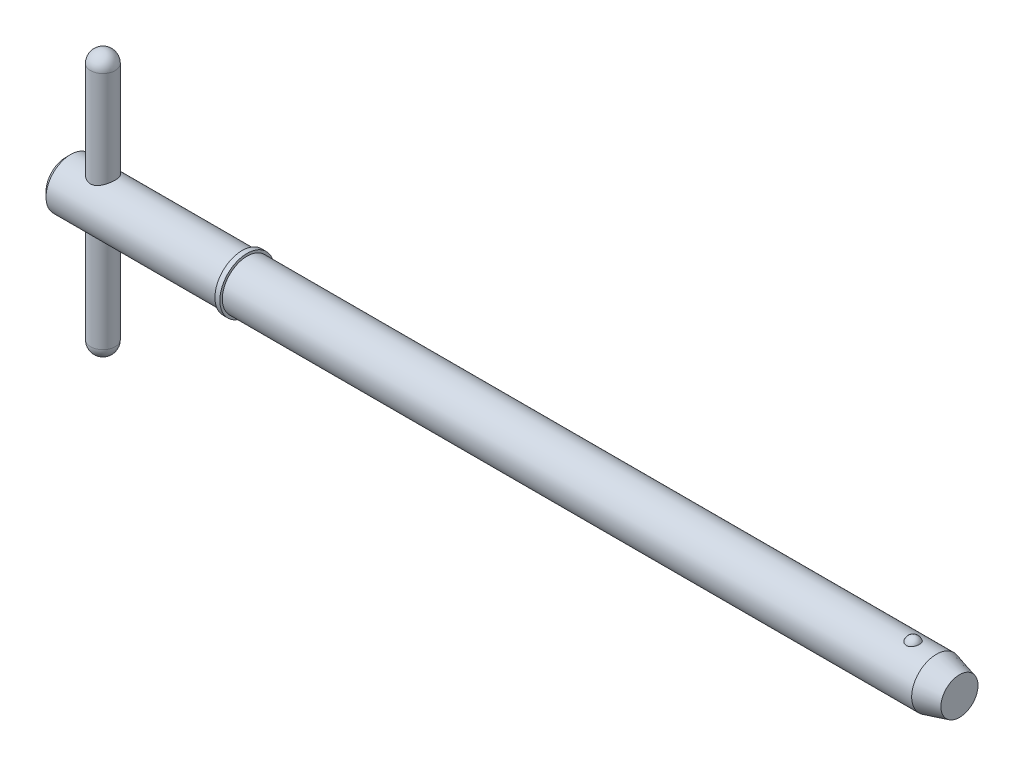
ISO-10303-21;
HEADER;
FILE_DESCRIPTION(('STEP AP214'),'2;1');
FILE_NAME('part.step','',(''),(''),'','','');
FILE_SCHEMA(('AUTOMOTIVE_DESIGN { 1 0 10303 214 1 1 1 1 }'));
ENDSEC;
DATA;
#1=APPLICATION_CONTEXT('core data for automotive mechanical design processes');
#2=APPLICATION_PROTOCOL_DEFINITION('international standard','automotive_design',2000,#1);
#3=PRODUCT_CONTEXT('',#1,'mechanical');
#4=PRODUCT('Part','Part','',(#3));
#5=PRODUCT_RELATED_PRODUCT_CATEGORY('part','',(#4));
#6=PRODUCT_DEFINITION_FORMATION('','',#4);
#7=PRODUCT_DEFINITION_CONTEXT('part definition',#1,'design');
#8=PRODUCT_DEFINITION('design','',#6,#7);
#9=PRODUCT_DEFINITION_SHAPE('','',#8);
#10=(LENGTH_UNIT() NAMED_UNIT(*) SI_UNIT(.MILLI.,.METRE.));
#11=(NAMED_UNIT(*) PLANE_ANGLE_UNIT() SI_UNIT($,.RADIAN.));
#12=(NAMED_UNIT(*) SI_UNIT($,.STERADIAN.) SOLID_ANGLE_UNIT());
#13=UNCERTAINTY_MEASURE_WITH_UNIT(LENGTH_MEASURE(1.E-05),#10,'distance_accuracy_value','');
#14=(GEOMETRIC_REPRESENTATION_CONTEXT(3) GLOBAL_UNCERTAINTY_ASSIGNED_CONTEXT((#13)) GLOBAL_UNIT_ASSIGNED_CONTEXT((#10,
#11,#12)) REPRESENTATION_CONTEXT('',''));
#15=CARTESIAN_POINT('',(0.,0.,0.));
#16=DIRECTION('',(0.,0.,1.));
#17=DIRECTION('',(1.,0.,0.));
#18=AXIS2_PLACEMENT_3D('',#15,#16,#17);
#19=CARTESIAN_POINT('',(3.57,12.7,0.));
#20=DIRECTION('',(0.,-1.,0.));
#21=DIRECTION('',(0.,0.,-1.));
#22=AXIS2_PLACEMENT_3D('',#19,#20,#21);
#23=CYLINDRICAL_SURFACE('',#22,1.19);
#24=CARTESIAN_POINT('',(3.57,-11.51,0.));
#25=DIRECTION('',(0.,-1.,0.));
#26=DIRECTION('',(0.,0.,-1.));
#27=AXIS2_PLACEMENT_3D('',#24,#25,#26);
#28=CIRCLE('',#27,1.19);
#29=CARTESIAN_POINT('',(3.57,-11.51,-1.19));
#30=VERTEX_POINT('',#29);
#31=EDGE_CURVE('P0_E10',#30,#30,#28,.F.);
#32=ORIENTED_EDGE('',*,*,#31,.T.);
#33=EDGE_LOOP('',(#32));
#34=FACE_BOUND('',#33,.T.);
#35=CARTESIAN_POINT('',(3.57,11.51,0.));
#36=DIRECTION('',(0.,-1.,0.));
#37=DIRECTION('',(0.,0.,-1.));
#38=AXIS2_PLACEMENT_3D('',#35,#36,#37);
#39=CIRCLE('',#38,1.19);
#40=CARTESIAN_POINT('',(3.57,11.51,-1.19));
#41=VERTEX_POINT('',#40);
#42=EDGE_CURVE('P0_E21',#41,#41,#39,.T.);
#43=ORIENTED_EDGE('',*,*,#42,.T.);
#44=EDGE_LOOP('',(#43));
#45=FACE_BOUND('',#44,.T.);
#46=ADVANCED_FACE('P0_F14',(#34,#45),#23,.T.);
#47=CARTESIAN_POINT('',(3.57,-11.51,0.));
#48=DIRECTION('',(0.,0.,1.));
#49=DIRECTION('',(1.,0.,0.));
#50=AXIS2_PLACEMENT_3D('',#47,#48,#49);
#51=SPHERICAL_SURFACE('',#50,1.19);
#52=CARTESIAN_POINT('',(3.57,-11.51,0.));
#53=DIRECTION('',(0.,-1.,0.));
#54=DIRECTION('',(0.,0.,-1.));
#55=AXIS2_PLACEMENT_3D('',#52,#53,#54);
#56=SPHERICAL_SURFACE('',#55,1.19);
#57=ORIENTED_EDGE('',*,*,#31,.F.);
#58=EDGE_LOOP('',(#57));
#59=FACE_BOUND('',#58,.T.);
#60=ADVANCED_FACE('P0_F29',(#59),#56,.T.);
#61=CARTESIAN_POINT('',(3.57,11.51,0.));
#62=DIRECTION('',(0.,0.,1.));
#63=DIRECTION('',(1.,0.,0.));
#64=AXIS2_PLACEMENT_3D('',#61,#62,#63);
#65=SPHERICAL_SURFACE('',#64,1.19);
#66=CARTESIAN_POINT('',(3.57,11.51,0.));
#67=DIRECTION('',(0.,-1.,0.));
#68=DIRECTION('',(0.,0.,-1.));
#69=AXIS2_PLACEMENT_3D('',#66,#67,#68);
#70=SPHERICAL_SURFACE('',#69,1.19);
#71=ORIENTED_EDGE('',*,*,#42,.F.);
#72=EDGE_LOOP('',(#71));
#73=FACE_BOUND('',#72,.T.);
#74=ADVANCED_FACE('P0_F16',(#73),#70,.T.);
#75=CLOSED_SHELL('',(#46,#60,#74));
#76=MANIFOLD_SOLID_BREP('P0_B1',#75);
#77=CARTESIAN_POINT('',(0.,0.,0.));
#78=DIRECTION('',(1.,0.,0.));
#79=DIRECTION('',(0.,0.,-1.));
#80=AXIS2_PLACEMENT_3D('',#77,#78,#79);
#81=CYLINDRICAL_SURFACE('',#80,2.38);
#82=CARTESIAN_POINT('',(83.8094297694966,0.,0.));
#83=DIRECTION('',(1.,0.,0.));
#84=DIRECTION('',(0.,0.,-1.));
#85=AXIS2_PLACEMENT_3D('',#82,#83,#84);
#86=CIRCLE('',#85,2.38);
#87=CARTESIAN_POINT('',(83.8094297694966,0.,-2.38));
#88=VERTEX_POINT('',#87);
#89=EDGE_CURVE('P1_E81',#88,#88,#86,.T.);
#90=ORIENTED_EDGE('',*,*,#89,.F.);
#91=EDGE_LOOP('',(#90));
#92=FACE_BOUND('',#91,.T.);
#93=CARTESIAN_POINT('',(17.45,0.,0.));
#94=DIRECTION('',(1.,0.,0.));
#95=DIRECTION('',(0.,0.,-1.));
#96=AXIS2_PLACEMENT_3D('',#93,#94,#95);
#97=CIRCLE('',#96,2.38);
#98=CARTESIAN_POINT('',(17.45,0.,-2.38));
#99=VERTEX_POINT('',#98);
#100=EDGE_CURVE('P1_E85',#99,#99,#97,.T.);
#101=ORIENTED_EDGE('',*,*,#100,.T.);
#102=EDGE_LOOP('',(#101));
#103=FACE_BOUND('',#102,.T.);
#104=CARTESIAN_POINT('',(81.5634492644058,2.2921568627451,0.640637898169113));
#105=CARTESIAN_POINT('',(81.5303559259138,2.29215737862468,0.64063719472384));
#106=CARTESIAN_POINT('',(81.4972546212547,2.29293179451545,0.637884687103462));
#107=CARTESIAN_POINT('',(81.4320176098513,2.29594030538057,0.626968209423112));
#108=CARTESIAN_POINT('',(81.3998823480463,2.29817506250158,0.618801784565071));
#109=CARTESIAN_POINT('',(81.3375402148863,2.3038430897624,0.597351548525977));
#110=CARTESIAN_POINT('',(81.3073305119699,2.30727454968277,0.584075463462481));
#111=CARTESIAN_POINT('',(81.2495674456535,2.31495941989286,0.552829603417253));
#112=CARTESIAN_POINT('',(81.2220141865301,2.31921286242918,0.534859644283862));
#113=CARTESIAN_POINT('',(81.1695938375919,2.32820213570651,0.494282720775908));
#114=CARTESIAN_POINT('',(81.1448050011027,2.33294694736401,0.471576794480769));
#115=CARTESIAN_POINT('',(81.0992169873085,2.34234144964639,0.422446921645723));
#116=CARTESIAN_POINT('',(81.0784185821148,2.34699112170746,0.396022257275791));
#117=CARTESIAN_POINT('',(81.0403580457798,2.35593942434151,0.33885587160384));
#118=CARTESIAN_POINT('',(81.0233051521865,2.36021170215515,0.307970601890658));
#119=CARTESIAN_POINT('',(80.9943607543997,2.3677057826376,0.243750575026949));
#120=CARTESIAN_POINT('',(80.9824701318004,2.37092740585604,0.210415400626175));
#121=CARTESIAN_POINT('',(80.9638076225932,2.37606901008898,0.141189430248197));
#122=CARTESIAN_POINT('',(80.9571956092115,2.37794816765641,0.105252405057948));
#123=CARTESIAN_POINT('',(80.9498095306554,2.38005135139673,0.0327351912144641));
#124=CARTESIAN_POINT('',(80.9490358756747,2.38027526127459,-0.00384504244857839));
#125=CARTESIAN_POINT('',(80.9533628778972,2.37903842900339,-0.0769838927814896));
#126=CARTESIAN_POINT('',(80.9585202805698,2.37756141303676,-0.113538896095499));
#127=CARTESIAN_POINT('',(80.9747013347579,2.37305303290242,-0.185229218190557));
#128=CARTESIAN_POINT('',(80.9857251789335,2.37002161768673,-0.220364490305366));
#129=CARTESIAN_POINT('',(81.0133977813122,2.36273722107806,-0.288156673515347));
#130=CARTESIAN_POINT('',(81.0300389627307,2.35848588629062,-0.320816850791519));
#131=CARTESIAN_POINT('',(81.0685984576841,2.34923130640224,-0.382744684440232));
#132=CARTESIAN_POINT('',(81.090516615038,2.34422808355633,-0.412012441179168));
#133=CARTESIAN_POINT('',(81.1387549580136,2.33412555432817,-0.465830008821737));
#134=CARTESIAN_POINT('',(81.1650028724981,2.32902887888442,-0.490444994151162));
#135=CARTESIAN_POINT('',(81.2214769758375,2.31926941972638,-0.534700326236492));
#136=CARTESIAN_POINT('',(81.251702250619,2.3146065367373,-0.554341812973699));
#137=CARTESIAN_POINT('',(81.3140618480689,2.30645675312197,-0.587312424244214));
#138=CARTESIAN_POINT('',(81.3460780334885,2.30293152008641,-0.600855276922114));
#139=CARTESIAN_POINT('',(81.4120795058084,2.29725171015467,-0.622220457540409));
#140=CARTESIAN_POINT('',(81.4460641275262,2.29509667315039,-0.630044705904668));
#141=CARTESIAN_POINT('',(81.513299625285,2.29249264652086,-0.639452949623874));
#142=CARTESIAN_POINT('',(81.5465087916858,2.29196755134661,-0.641315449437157));
#143=CARTESIAN_POINT('',(81.612763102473,2.29246849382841,-0.639522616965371));
#144=CARTESIAN_POINT('',(81.6458082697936,2.29349430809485,-0.635868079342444));
#145=CARTESIAN_POINT('',(81.7101025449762,2.29694059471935,-0.623301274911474));
#146=CARTESIAN_POINT('',(81.7413744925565,2.29933234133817,-0.614497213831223));
#147=CARTESIAN_POINT('',(81.8019952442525,2.30522511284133,-0.592006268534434));
#148=CARTESIAN_POINT('',(81.8313438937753,2.30872622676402,-0.578318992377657));
#149=CARTESIAN_POINT('',(81.8880369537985,2.31655795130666,-0.546112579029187));
#150=CARTESIAN_POINT('',(81.915320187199,2.32090569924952,-0.527490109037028));
#151=CARTESIAN_POINT('',(81.9664904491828,2.3299220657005,-0.486117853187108));
#152=CARTESIAN_POINT('',(81.9903767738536,2.33459075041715,-0.463367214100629));
#153=CARTESIAN_POINT('',(82.0352722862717,2.34399834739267,-0.413220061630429));
#154=CARTESIAN_POINT('',(82.0560972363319,2.34873051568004,-0.38565730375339));
#155=CARTESIAN_POINT('',(82.093056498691,2.35754932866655,-0.327455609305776));
#156=CARTESIAN_POINT('',(82.1091898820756,2.36163584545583,-0.296816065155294));
#157=CARTESIAN_POINT('',(82.1369822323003,2.36889321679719,-0.232047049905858));
#158=CARTESIAN_POINT('',(82.1484450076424,2.37202275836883,-0.19782862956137));
#159=CARTESIAN_POINT('',(82.1657523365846,2.37681926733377,-0.127900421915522));
#160=CARTESIAN_POINT('',(82.1715962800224,2.37848607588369,-0.0921904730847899));
#161=CARTESIAN_POINT('',(82.177605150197,2.38020024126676,-0.0196348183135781));
#162=CARTESIAN_POINT('',(82.1776704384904,2.38021918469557,0.0172198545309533));
#163=CARTESIAN_POINT('',(82.1718689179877,2.37856356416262,0.0904219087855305));
#164=CARTESIAN_POINT('',(82.1660018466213,2.37688892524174,0.126769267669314));
#165=CARTESIAN_POINT('',(82.148425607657,2.37201688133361,0.198028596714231));
#166=CARTESIAN_POINT('',(82.1366998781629,2.36881516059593,0.232936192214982));
#167=CARTESIAN_POINT('',(82.1076354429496,2.36123444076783,0.30019678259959));
#168=CARTESIAN_POINT('',(82.0902967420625,2.3568554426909,0.332549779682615));
#169=CARTESIAN_POINT('',(82.0505350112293,2.34744667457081,0.393495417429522));
#170=CARTESIAN_POINT('',(82.0281528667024,2.34242227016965,0.422115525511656));
#171=CARTESIAN_POINT('',(81.9787391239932,2.33227293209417,0.475004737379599));
#172=CARTESIAN_POINT('',(81.9517076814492,2.32714800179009,0.49927398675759));
#173=CARTESIAN_POINT('',(81.8944988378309,2.31755359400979,0.542046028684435));
#174=CARTESIAN_POINT('',(81.8644297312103,2.3130698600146,0.560690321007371));
#175=CARTESIAN_POINT('',(81.8013869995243,2.30514125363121,0.592447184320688));
#176=CARTESIAN_POINT('',(81.7684158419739,2.30169550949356,0.605564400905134));
#177=CARTESIAN_POINT('',(81.7068424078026,2.29677744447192,0.623927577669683));
#178=CARTESIAN_POINT('',(81.6785555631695,2.295058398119,0.630178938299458));
#179=CARTESIAN_POINT('',(81.6213308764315,2.29274795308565,0.638534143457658));
#180=CARTESIAN_POINT('',(81.5923931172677,2.29215641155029,0.640638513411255));
#181=CARTESIAN_POINT('',(81.5634492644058,2.2921568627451,0.640637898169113));
#182=B_SPLINE_CURVE_WITH_KNOTS('',3,(#104,#105,#106,#107,#108,#109,#110,#111,#112,#113,#114,
#115,#116,#117,#118,#119,#120,#121,#122,#123,#124,#125,#126,#127,#128,#129,#130,#131,#132,#133,
#134,#135,#136,#137,#138,#139,#140,#141,#142,#143,#144,#145,#146,#147,#148,#149,#150,#151,#152,
#153,#154,#155,#156,#157,#158,#159,#160,#161,#162,#163,#164,#165,#166,#167,#168,#169,#170,#171,
#172,#173,#174,#175,#176,#177,#178,#179,#180,#181),.UNSPECIFIED.,.T.,.F.,(4,2,2,2,2,2,2,2,2,2,2,
2,2,2,2,2,2,2,2,2,2,2,2,2,2,2,2,2,2,2,2,2,2,2,2,2,2,2,4),(0.,0.0991724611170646,
0.198389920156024,0.297457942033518,0.396529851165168,0.497927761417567,0.599345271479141,
0.70547553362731,0.811623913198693,0.920876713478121,1.03013718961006,1.14045177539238,
1.25076998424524,1.36093998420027,1.47110672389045,1.57959248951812,1.68805336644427,
1.79234266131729,1.89659691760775,1.99590391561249,2.09519661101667,2.19247425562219,
2.2897597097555,2.38926978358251,2.48880044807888,2.59293588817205,2.69709193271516,
2.80525821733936,2.91343624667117,3.0234791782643,3.13352698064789,3.24388765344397,
3.35424823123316,3.46374443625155,3.5732369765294,3.67968690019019,3.78604717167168,
3.87279565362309,3.9595331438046),.UNSPECIFIED.);
#183=CARTESIAN_POINT('',(81.5634492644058,2.2921568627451,0.640637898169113));
#184=VERTEX_POINT('',#183);
#185=EDGE_CURVE('P1_E35',#184,#184,#182,.T.);
#186=ORIENTED_EDGE('',*,*,#185,.T.);
#187=EDGE_LOOP('',(#186));
#188=FACE_BOUND('',#187,.T.);
#189=ADVANCED_FACE('P1_F13',(#92,#103,#188),#81,.T.);
#190=CARTESIAN_POINT('',(0.,0.,0.));
#191=DIRECTION('',(-1.,0.,0.));
#192=DIRECTION('',(0.,0.,1.));
#193=AXIS2_PLACEMENT_3D('',#190,#191,#192);
#194=PLANE('',#193);
#195=CARTESIAN_POINT('',(0.,0.,0.));
#196=DIRECTION('',(1.,0.,0.));
#197=DIRECTION('',(0.,0.,-1.));
#198=AXIS2_PLACEMENT_3D('',#195,#196,#197);
#199=CIRCLE('',#198,1.904);
#200=CARTESIAN_POINT('',(0.,0.,-1.904));
#201=VERTEX_POINT('',#200);
#202=EDGE_CURVE('P1_E9',#201,#201,#199,.T.);
#203=ORIENTED_EDGE('',*,*,#202,.F.);
#204=EDGE_LOOP('',(#203));
#205=FACE_BOUND('',#204,.T.);
#206=ADVANCED_FACE('P1_F15',(#205),#194,.T.);
#207=CARTESIAN_POINT('',(0.475999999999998,0.,0.));
#208=DIRECTION('',(1.,0.,0.));
#209=DIRECTION('',(0.,0.,-1.));
#210=AXIS2_PLACEMENT_3D('',#207,#208,#209);
#211=CONICAL_SURFACE('',#210,2.38,0.78539816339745);
#212=ORIENTED_EDGE('',*,*,#202,.T.);
#213=EDGE_LOOP('',(#212));
#214=FACE_BOUND('',#213,.T.);
#215=CARTESIAN_POINT('',(0.475999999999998,0.,0.));
#216=DIRECTION('',(1.,0.,0.));
#217=DIRECTION('',(0.,0.,-1.));
#218=AXIS2_PLACEMENT_3D('',#215,#216,#217);
#219=CIRCLE('',#218,2.38);
#220=CARTESIAN_POINT('',(0.475999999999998,0.,-2.38));
#221=VERTEX_POINT('',#220);
#222=EDGE_CURVE('P1_E26',#221,#221,#219,.T.);
#223=ORIENTED_EDGE('',*,*,#222,.F.);
#224=EDGE_LOOP('',(#223));
#225=FACE_BOUND('',#224,.T.);
#226=ADVANCED_FACE('P1_F77',(#214,#225),#211,.T.);
#227=CARTESIAN_POINT('',(0.,0.,0.));
#228=DIRECTION('',(1.,0.,0.));
#229=DIRECTION('',(0.,0.,-1.));
#230=AXIS2_PLACEMENT_3D('',#227,#228,#229);
#231=CYLINDRICAL_SURFACE('',#230,2.38);
#232=CARTESIAN_POINT('',(3.57,-2.06114046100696,1.19));
#233=CARTESIAN_POINT('',(3.50799170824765,-2.06114586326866,1.18999567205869));
#234=CARTESIAN_POINT('',(3.4459051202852,-2.0639812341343,1.18512096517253));
#235=CARTESIAN_POINT('',(3.32363755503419,-2.07491216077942,1.16587061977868));
#236=CARTESIAN_POINT('',(3.26346086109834,-2.08301876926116,1.15147501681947));
#237=CARTESIAN_POINT('',(3.14701251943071,-2.10331722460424,1.11395893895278));
#238=CARTESIAN_POINT('',(3.09072196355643,-2.1154873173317,1.09088484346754));
#239=CARTESIAN_POINT('',(2.9828251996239,-2.14250771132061,1.03680835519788));
#240=CARTESIAN_POINT('',(2.93121924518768,-2.15735815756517,1.00580553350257));
#241=CARTESIAN_POINT('',(2.82945618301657,-2.18956274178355,0.933753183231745));
#242=CARTESIAN_POINT('',(2.77976962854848,-2.20702235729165,0.892085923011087));
#243=CARTESIAN_POINT('',(2.68772401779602,-2.2416265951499,0.801172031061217));
#244=CARTESIAN_POINT('',(2.64536861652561,-2.25877105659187,0.751921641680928));
#245=CARTESIAN_POINT('',(2.56639309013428,-2.29219557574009,0.64318258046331));
#246=CARTESIAN_POINT('',(2.53035201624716,-2.30833946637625,0.583227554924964));
#247=CARTESIAN_POINT('',(2.46908238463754,-2.3365739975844,0.45714686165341));
#248=CARTESIAN_POINT('',(2.44384700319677,-2.34866719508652,0.391025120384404));
#249=CARTESIAN_POINT('',(2.40676945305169,-2.36667748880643,0.259473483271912));
#250=CARTESIAN_POINT('',(2.39410206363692,-2.37297281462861,0.194329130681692));
#251=CARTESIAN_POINT('',(2.3798023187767,-2.3800902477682,0.0625590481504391));
#252=CARTESIAN_POINT('',(2.37816328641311,-2.38091566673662,-0.00406576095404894));
#253=CARTESIAN_POINT('',(2.38564854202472,-2.37717948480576,-0.130700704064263));
#254=CARTESIAN_POINT('',(2.39384923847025,-2.37308010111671,-0.190782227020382));
#255=CARTESIAN_POINT('',(2.41912820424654,-2.360653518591,-0.308583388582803));
#256=CARTESIAN_POINT('',(2.43620713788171,-2.35232600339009,-0.366302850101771));
#257=CARTESIAN_POINT('',(2.47886825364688,-2.33206184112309,-0.478748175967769));
#258=CARTESIAN_POINT('',(2.50456481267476,-2.32007685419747,-0.533421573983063));
#259=CARTESIAN_POINT('',(2.56357346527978,-2.29357798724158,-0.637812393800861));
#260=CARTESIAN_POINT('',(2.5968882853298,-2.27906320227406,-0.687528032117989));
#261=CARTESIAN_POINT('',(2.67380546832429,-2.24724829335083,-0.785606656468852));
#262=CARTESIAN_POINT('',(2.71808260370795,-2.22981457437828,-0.833397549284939));
#263=CARTESIAN_POINT('',(2.81386177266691,-2.19500665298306,-0.921184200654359));
#264=CARTESIAN_POINT('',(2.86536931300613,-2.17763250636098,-0.961173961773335));
#265=CARTESIAN_POINT('',(2.97815134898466,-2.14371545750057,-1.03471134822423));
#266=CARTESIAN_POINT('',(3.03983836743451,-2.12729540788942,-1.06768860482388));
#267=CARTESIAN_POINT('',(3.16889582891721,-2.09886785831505,-1.12254974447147));
#268=CARTESIAN_POINT('',(3.2362602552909,-2.0868557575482,-1.14444520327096));
#269=CARTESIAN_POINT('',(3.36914526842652,-2.06994116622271,-1.1747444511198));
#270=CARTESIAN_POINT('',(3.43438893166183,-2.06455070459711,-1.18407989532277));
#271=CARTESIAN_POINT('',(3.56571759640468,-2.06010324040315,-1.1918051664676));
#272=CARTESIAN_POINT('',(3.63180197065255,-2.06104176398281,-1.19020272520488));
#273=CARTESIAN_POINT('',(3.75522816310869,-2.06862860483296,-1.17695289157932));
#274=CARTESIAN_POINT('',(3.81273554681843,-2.07464109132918,-1.16642350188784));
#275=CARTESIAN_POINT('',(3.92505766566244,-2.09075885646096,-1.1372785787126));
#276=CARTESIAN_POINT('',(3.97987152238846,-2.1008654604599,-1.1186604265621));
#277=CARTESIAN_POINT('',(4.08813948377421,-2.12458104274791,-1.07296063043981));
#278=CARTESIAN_POINT('',(4.14141303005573,-2.13833055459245,-1.04552693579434));
#279=CARTESIAN_POINT('',(4.2429084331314,-2.16765782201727,-0.983281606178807));
#280=CARTESIAN_POINT('',(4.29112767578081,-2.18323651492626,-0.948466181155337));
#281=CARTESIAN_POINT('',(4.38750473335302,-2.2168271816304,-0.867316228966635));
#282=CARTESIAN_POINT('',(4.43488860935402,-2.23489833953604,-0.82008287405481));
#283=CARTESIAN_POINT('',(4.52130056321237,-2.26973739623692,-0.718051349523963));
#284=CARTESIAN_POINT('',(4.56032581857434,-2.28650485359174,-0.663250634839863));
#285=CARTESIAN_POINT('',(4.62978273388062,-2.31742220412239,-0.545657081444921));
#286=CARTESIAN_POINT('',(4.65996041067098,-2.33149133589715,-0.482691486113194));
#287=CARTESIAN_POINT('',(4.7089941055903,-2.35481192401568,-0.351671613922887));
#288=CARTESIAN_POINT('',(4.7278600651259,-2.36406760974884,-0.283621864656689));
#289=CARTESIAN_POINT('',(4.75210859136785,-2.3760433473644,-0.151105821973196));
#290=CARTESIAN_POINT('',(4.75856947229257,-2.37928514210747,-0.0868836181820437));
#291=CARTESIAN_POINT('',(4.76100348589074,-2.38050135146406,0.0417999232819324));
#292=CARTESIAN_POINT('',(4.75698028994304,-2.37847760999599,0.106261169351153));
#293=CARTESIAN_POINT('',(4.73927447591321,-2.36969422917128,0.229120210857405));
#294=CARTESIAN_POINT('',(4.72624582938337,-2.36325544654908,0.287637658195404));
#295=CARTESIAN_POINT('',(4.69178087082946,-2.34658591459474,0.401560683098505));
#296=CARTESIAN_POINT('',(4.67034335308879,-2.33635462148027,0.456965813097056));
#297=CARTESIAN_POINT('',(4.61871480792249,-2.31247857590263,0.565753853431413));
#298=CARTESIAN_POINT('',(4.58818860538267,-2.29870654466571,0.618948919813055));
#299=CARTESIAN_POINT('',(4.51967006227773,-2.26918878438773,0.719681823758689));
#300=CARTESIAN_POINT('',(4.48167429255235,-2.25344215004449,0.76721704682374));
#301=CARTESIAN_POINT('',(4.39491140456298,-2.21969046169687,0.860267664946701));
#302=CARTESIAN_POINT('',(4.34544863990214,-2.20161660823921,0.905111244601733));
#303=CARTESIAN_POINT('',(4.23943364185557,-2.16655060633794,0.986109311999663));
#304=CARTESIAN_POINT('',(4.18287520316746,-2.1495594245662,1.02225611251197));
#305=CARTESIAN_POINT('',(4.06190239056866,-2.1181953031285,1.08579298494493));
#306=CARTESIAN_POINT('',(3.9972962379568,-2.10392207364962,1.11287022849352));
#307=CARTESIAN_POINT('',(3.86353443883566,-2.08090726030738,1.15534566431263));
#308=CARTESIAN_POINT('',(3.7943948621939,-2.07214719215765,1.17078291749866));
#309=CARTESIAN_POINT('',(3.69875162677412,-2.06499834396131,1.18329673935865));
#310=CARTESIAN_POINT('',(3.67309220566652,-2.06355673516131,1.18580656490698));
#311=CARTESIAN_POINT('',(3.62162638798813,-2.06162663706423,1.18915915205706));
#312=CARTESIAN_POINT('',(3.59581998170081,-2.0611382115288,1.19000180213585));
#313=CARTESIAN_POINT('',(3.57,-2.06114046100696,1.19));
#314=B_SPLINE_CURVE_WITH_KNOTS('',3,(#232,#233,#234,#235,#236,#237,#238,#239,#240,#241,#242,
#243,#244,#245,#246,#247,#248,#249,#250,#251,#252,#253,#254,#255,#256,#257,#258,#259,#260,#261,
#262,#263,#264,#265,#266,#267,#268,#269,#270,#271,#272,#273,#274,#275,#276,#277,#278,#279,#280,
#281,#282,#283,#284,#285,#286,#287,#288,#289,#290,#291,#292,#293,#294,#295,#296,#297,#298,#299,
#300,#301,#302,#303,#304,#305,#306,#307,#308,#309,#310,#311,#312,#313),.UNSPECIFIED.,.T.,.F.,(4,
2,2,2,2,2,2,2,2,2,2,2,2,2,2,2,2,2,2,2,2,2,2,2,2,2,2,2,2,2,2,2,2,2,2,2,2,2,2,2,4),(0.,
0.185916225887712,0.372223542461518,0.557549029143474,0.742884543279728,0.943506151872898,
1.14422749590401,1.35847891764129,1.5725948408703,1.77147547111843,1.97023568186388,
2.15171156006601,2.33320101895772,2.51720146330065,2.70126786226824,2.902733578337,
3.10435357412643,3.31877721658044,3.53297641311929,3.73020126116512,3.92728670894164,
4.1028127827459,4.27839572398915,4.46211082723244,4.64592048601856,4.8529002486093,
5.0599497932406,5.27246375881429,5.48479067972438,5.67763601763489,5.87041383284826,
6.05048865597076,6.23058930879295,6.41839293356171,6.60628297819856,6.8128718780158,
7.01964271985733,7.2329479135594,7.44553408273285,7.52294360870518,7.60035831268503),.UNSPECIFIED.);
#315=CARTESIAN_POINT('',(3.57,-2.06114046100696,1.19));
#316=VERTEX_POINT('',#315);
#317=EDGE_CURVE('P1_E17',#316,#316,#314,.T.);
#318=ORIENTED_EDGE('',*,*,#317,.F.);
#319=EDGE_LOOP('',(#318));
#320=FACE_BOUND('',#319,.T.);
#321=CARTESIAN_POINT('',(3.57,2.06114046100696,1.19));
#322=CARTESIAN_POINT('',(3.63200829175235,2.06114586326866,1.18999567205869));
#323=CARTESIAN_POINT('',(3.6940948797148,2.0639812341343,1.18512096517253));
#324=CARTESIAN_POINT('',(3.81636244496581,2.07491216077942,1.16587061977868));
#325=CARTESIAN_POINT('',(3.87653913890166,2.08301876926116,1.15147501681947));
#326=CARTESIAN_POINT('',(3.99298748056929,2.10331722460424,1.11395893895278));
#327=CARTESIAN_POINT('',(4.04927803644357,2.1154873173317,1.09088484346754));
#328=CARTESIAN_POINT('',(4.1571748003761,2.14250771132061,1.03680835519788));
#329=CARTESIAN_POINT('',(4.20878075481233,2.15735815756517,1.00580553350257));
#330=CARTESIAN_POINT('',(4.31054381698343,2.18956274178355,0.933753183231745));
#331=CARTESIAN_POINT('',(4.36023037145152,2.20702235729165,0.892085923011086));
#332=CARTESIAN_POINT('',(4.45227598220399,2.2416265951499,0.801172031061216));
#333=CARTESIAN_POINT('',(4.49463138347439,2.25877105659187,0.751921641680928));
#334=CARTESIAN_POINT('',(4.57360690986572,2.29219557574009,0.643182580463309));
#335=CARTESIAN_POINT('',(4.60964798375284,2.30833946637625,0.583227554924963));
#336=CARTESIAN_POINT('',(4.67091761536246,2.3365739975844,0.457146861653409));
#337=CARTESIAN_POINT('',(4.69615299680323,2.34866719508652,0.391025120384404));
#338=CARTESIAN_POINT('',(4.73323054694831,2.36667748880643,0.259473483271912));
#339=CARTESIAN_POINT('',(4.74589793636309,2.37297281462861,0.194329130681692));
#340=CARTESIAN_POINT('',(4.7601976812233,2.3800902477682,0.0625590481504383));
#341=CARTESIAN_POINT('',(4.76183671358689,2.38091566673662,-0.00406576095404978));
#342=CARTESIAN_POINT('',(4.75435145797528,2.37717948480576,-0.130700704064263));
#343=CARTESIAN_POINT('',(4.74615076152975,2.37308010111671,-0.190782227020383));
#344=CARTESIAN_POINT('',(4.72087179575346,2.360653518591,-0.308583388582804));
#345=CARTESIAN_POINT('',(4.70379286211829,2.35232600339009,-0.366302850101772));
#346=CARTESIAN_POINT('',(4.66113174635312,2.33206184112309,-0.478748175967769));
#347=CARTESIAN_POINT('',(4.63543518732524,2.32007685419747,-0.533421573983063));
#348=CARTESIAN_POINT('',(4.57642653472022,2.29357798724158,-0.637812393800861));
#349=CARTESIAN_POINT('',(4.5431117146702,2.27906320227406,-0.687528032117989));
#350=CARTESIAN_POINT('',(4.46619453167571,2.24724829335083,-0.785606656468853));
#351=CARTESIAN_POINT('',(4.42191739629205,2.22981457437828,-0.83339754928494));
#352=CARTESIAN_POINT('',(4.32613822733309,2.19500665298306,-0.921184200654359));
#353=CARTESIAN_POINT('',(4.27463068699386,2.17763250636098,-0.961173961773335));
#354=CARTESIAN_POINT('',(4.16184865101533,2.14371545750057,-1.03471134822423));
#355=CARTESIAN_POINT('',(4.10016163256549,2.12729540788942,-1.06768860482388));
#356=CARTESIAN_POINT('',(3.97110417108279,2.09886785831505,-1.12254974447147));
#357=CARTESIAN_POINT('',(3.9037397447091,2.0868557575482,-1.14444520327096));
#358=CARTESIAN_POINT('',(3.77085473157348,2.06994116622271,-1.1747444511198));
#359=CARTESIAN_POINT('',(3.70561106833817,2.06455070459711,-1.18407989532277));
#360=CARTESIAN_POINT('',(3.57428240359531,2.06010324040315,-1.1918051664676));
#361=CARTESIAN_POINT('',(3.50819802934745,2.06104176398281,-1.19020272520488));
#362=CARTESIAN_POINT('',(3.38477183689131,2.06862860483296,-1.17695289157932));
#363=CARTESIAN_POINT('',(3.32726445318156,2.07464109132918,-1.16642350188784));
#364=CARTESIAN_POINT('',(3.21494233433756,2.09075885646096,-1.1372785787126));
#365=CARTESIAN_POINT('',(3.16012847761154,2.1008654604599,-1.1186604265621));
#366=CARTESIAN_POINT('',(3.05186051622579,2.12458104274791,-1.07296063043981));
#367=CARTESIAN_POINT('',(2.99858696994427,2.13833055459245,-1.04552693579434));
#368=CARTESIAN_POINT('',(2.8970915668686,2.16765782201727,-0.983281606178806));
#369=CARTESIAN_POINT('',(2.84887232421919,2.18323651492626,-0.948466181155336));
#370=CARTESIAN_POINT('',(2.75249526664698,2.2168271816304,-0.867316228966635));
#371=CARTESIAN_POINT('',(2.70511139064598,2.23489833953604,-0.820082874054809));
#372=CARTESIAN_POINT('',(2.61869943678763,2.26973739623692,-0.718051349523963));
#373=CARTESIAN_POINT('',(2.57967418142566,2.28650485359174,-0.663250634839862));
#374=CARTESIAN_POINT('',(2.51021726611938,2.31742220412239,-0.54565708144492));
#375=CARTESIAN_POINT('',(2.48003958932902,2.33149133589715,-0.482691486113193));
#376=CARTESIAN_POINT('',(2.4310058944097,2.35481192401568,-0.351671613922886));
#377=CARTESIAN_POINT('',(2.4121399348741,2.36406760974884,-0.283621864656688));
#378=CARTESIAN_POINT('',(2.38789140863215,2.3760433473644,-0.151105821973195));
#379=CARTESIAN_POINT('',(2.38143052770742,2.37928514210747,-0.0868836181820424));
#380=CARTESIAN_POINT('',(2.37899651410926,2.38050135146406,0.0417999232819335));
#381=CARTESIAN_POINT('',(2.38301971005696,2.37847760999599,0.106261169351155));
#382=CARTESIAN_POINT('',(2.40072552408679,2.36969422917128,0.229120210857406));
#383=CARTESIAN_POINT('',(2.41375417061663,2.36325544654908,0.287637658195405));
#384=CARTESIAN_POINT('',(2.44821912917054,2.34658591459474,0.401560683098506));
#385=CARTESIAN_POINT('',(2.46965664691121,2.33635462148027,0.456965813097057));
#386=CARTESIAN_POINT('',(2.52128519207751,2.31247857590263,0.565753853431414));
#387=CARTESIAN_POINT('',(2.55181139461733,2.29870654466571,0.618948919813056));
#388=CARTESIAN_POINT('',(2.62032993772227,2.26918878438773,0.719681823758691));
#389=CARTESIAN_POINT('',(2.65832570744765,2.25344215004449,0.767217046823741));
#390=CARTESIAN_POINT('',(2.74508859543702,2.21969046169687,0.860267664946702));
#391=CARTESIAN_POINT('',(2.79455136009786,2.20161660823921,0.905111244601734));
#392=CARTESIAN_POINT('',(2.90056635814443,2.16655060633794,0.986109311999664));
#393=CARTESIAN_POINT('',(2.95712479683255,2.1495594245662,1.02225611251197));
#394=CARTESIAN_POINT('',(3.07809760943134,2.1181953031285,1.08579298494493));
#395=CARTESIAN_POINT('',(3.1427037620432,2.10392207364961,1.11287022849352));
#396=CARTESIAN_POINT('',(3.27646556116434,2.08090726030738,1.15534566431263));
#397=CARTESIAN_POINT('',(3.3456051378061,2.07214719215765,1.17078291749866));
#398=CARTESIAN_POINT('',(3.44124837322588,2.06499834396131,1.18329673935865));
#399=CARTESIAN_POINT('',(3.46690779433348,2.06355673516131,1.18580656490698));
#400=CARTESIAN_POINT('',(3.51837361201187,2.06162663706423,1.18915915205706));
#401=CARTESIAN_POINT('',(3.54418001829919,2.0611382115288,1.19000180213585));
#402=CARTESIAN_POINT('',(3.57,2.06114046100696,1.19));
#403=B_SPLINE_CURVE_WITH_KNOTS('',3,(#321,#322,#323,#324,#325,#326,#327,#328,#329,#330,#331,
#332,#333,#334,#335,#336,#337,#338,#339,#340,#341,#342,#343,#344,#345,#346,#347,#348,#349,#350,
#351,#352,#353,#354,#355,#356,#357,#358,#359,#360,#361,#362,#363,#364,#365,#366,#367,#368,#369,
#370,#371,#372,#373,#374,#375,#376,#377,#378,#379,#380,#381,#382,#383,#384,#385,#386,#387,#388,
#389,#390,#391,#392,#393,#394,#395,#396,#397,#398,#399,#400,#401,#402),.UNSPECIFIED.,.T.,.F.,(4,
2,2,2,2,2,2,2,2,2,2,2,2,2,2,2,2,2,2,2,2,2,2,2,2,2,2,2,2,2,2,2,2,2,2,2,2,2,2,2,4),(0.,
0.185916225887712,0.372223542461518,0.557549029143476,0.74288454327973,0.9435061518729,
1.14422749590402,1.35847891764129,1.5725948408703,1.77147547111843,1.97023568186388,
2.15171156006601,2.33320101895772,2.51720146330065,2.70126786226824,2.902733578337,
3.10435357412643,3.31877721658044,3.53297641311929,3.73020126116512,3.92728670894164,
4.1028127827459,4.27839572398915,4.46211082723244,4.64592048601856,4.8529002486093,
5.05994979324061,5.27246375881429,5.48479067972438,5.67763601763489,5.87041383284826,
6.05048865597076,6.23058930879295,6.41839293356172,6.60628297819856,6.8128718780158,
7.01964271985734,7.2329479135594,7.44553408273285,7.52294360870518,7.60035831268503),.UNSPECIFIED.);
#404=CARTESIAN_POINT('',(3.57,2.06114046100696,1.19));
#405=VERTEX_POINT('',#404);
#406=EDGE_CURVE('P1_E43',#405,#405,#403,.T.);
#407=ORIENTED_EDGE('',*,*,#406,.F.);
#408=EDGE_LOOP('',(#407));
#409=FACE_BOUND('',#408,.T.);
#410=ORIENTED_EDGE('',*,*,#222,.T.);
#411=EDGE_LOOP('',(#410));
#412=FACE_BOUND('',#411,.T.);
#413=CARTESIAN_POINT('',(16.974,0.,0.));
#414=DIRECTION('',(1.,0.,0.));
#415=DIRECTION('',(0.,0.,-1.));
#416=AXIS2_PLACEMENT_3D('',#413,#414,#415);
#417=CIRCLE('',#416,2.38);
#418=CARTESIAN_POINT('',(16.974,0.,-2.38));
#419=VERTEX_POINT('',#418);
#420=EDGE_CURVE('P1_E31',#419,#419,#417,.T.);
#421=ORIENTED_EDGE('',*,*,#420,.F.);
#422=EDGE_LOOP('',(#421));
#423=FACE_BOUND('',#422,.T.);
#424=ADVANCED_FACE('P1_F103',(#320,#409,#412,#423),#231,.T.);
#425=CARTESIAN_POINT('',(16.974,2.38,0.));
#426=DIRECTION('',(-1.,0.,0.));
#427=DIRECTION('',(0.,0.,1.));
#428=AXIS2_PLACEMENT_3D('',#425,#426,#427);
#429=PLANE('',#428);
#430=ORIENTED_EDGE('',*,*,#420,.T.);
#431=EDGE_LOOP('',(#430));
#432=FACE_BOUND('',#431,.T.);
#433=CARTESIAN_POINT('',(16.974,0.,0.));
#434=DIRECTION('',(1.,0.,0.));
#435=DIRECTION('',(0.,0.,-1.));
#436=AXIS2_PLACEMENT_3D('',#433,#434,#435);
#437=CIRCLE('',#436,2.618);
#438=CARTESIAN_POINT('',(16.974,0.,-2.618));
#439=VERTEX_POINT('',#438);
#440=EDGE_CURVE('P1_E91',#439,#439,#437,.T.);
#441=ORIENTED_EDGE('',*,*,#440,.F.);
#442=EDGE_LOOP('',(#441));
#443=FACE_BOUND('',#442,.T.);
#444=ADVANCED_FACE('P1_F100',(#432,#443),#429,.T.);
#445=CARTESIAN_POINT('',(0.,0.,0.));
#446=DIRECTION('',(1.,0.,0.));
#447=DIRECTION('',(0.,0.,-1.));
#448=AXIS2_PLACEMENT_3D('',#445,#446,#447);
#449=CYLINDRICAL_SURFACE('',#448,2.618);
#450=ORIENTED_EDGE('',*,*,#440,.T.);
#451=EDGE_LOOP('',(#450));
#452=FACE_BOUND('',#451,.T.);
#453=CARTESIAN_POINT('',(17.45,0.,0.));
#454=DIRECTION('',(1.,0.,0.));
#455=DIRECTION('',(0.,0.,-1.));
#456=AXIS2_PLACEMENT_3D('',#453,#454,#455);
#457=CIRCLE('',#456,2.618);
#458=CARTESIAN_POINT('',(17.45,0.,-2.618));
#459=VERTEX_POINT('',#458);
#460=EDGE_CURVE('P1_E88',#459,#459,#457,.T.);
#461=ORIENTED_EDGE('',*,*,#460,.F.);
#462=EDGE_LOOP('',(#461));
#463=FACE_BOUND('',#462,.T.);
#464=ADVANCED_FACE('P1_F68',(#452,#463),#449,.T.);
#465=CARTESIAN_POINT('',(17.45,2.618,0.));
#466=DIRECTION('',(1.,0.,0.));
#467=DIRECTION('',(0.,0.,-1.));
#468=AXIS2_PLACEMENT_3D('',#465,#466,#467);
#469=PLANE('',#468);
#470=ORIENTED_EDGE('',*,*,#460,.T.);
#471=EDGE_LOOP('',(#470));
#472=FACE_BOUND('',#471,.T.);
#473=ORIENTED_EDGE('',*,*,#100,.F.);
#474=EDGE_LOOP('',(#473));
#475=FACE_BOUND('',#474,.T.);
#476=ADVANCED_FACE('P1_F62',(#472,#475),#469,.T.);
#477=CARTESIAN_POINT('',(86.03,0.,0.));
#478=DIRECTION('',(-1.,0.,0.));
#479=DIRECTION('',(0.,0.,1.));
#480=AXIS2_PLACEMENT_3D('',#477,#478,#479);
#481=CONICAL_SURFACE('',#480,1.78500000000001,0.261799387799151);
#482=ORIENTED_EDGE('',*,*,#89,.T.);
#483=EDGE_LOOP('',(#482));
#484=FACE_BOUND('',#483,.T.);
#485=CARTESIAN_POINT('',(86.03,0.,0.));
#486=DIRECTION('',(1.,0.,0.));
#487=DIRECTION('',(0.,0.,-1.));
#488=AXIS2_PLACEMENT_3D('',#485,#486,#487);
#489=CIRCLE('',#488,1.78500000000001);
#490=CARTESIAN_POINT('',(86.03,0.,-1.78500000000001));
#491=VERTEX_POINT('',#490);
#492=EDGE_CURVE('P1_E42',#491,#491,#489,.T.);
#493=ORIENTED_EDGE('',*,*,#492,.F.);
#494=EDGE_LOOP('',(#493));
#495=FACE_BOUND('',#494,.T.);
#496=ADVANCED_FACE('P1_F59',(#484,#495),#481,.T.);
#497=CARTESIAN_POINT('',(86.03,1.78500000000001,0.));
#498=DIRECTION('',(1.,0.,0.));
#499=DIRECTION('',(0.,0.,-1.));
#500=AXIS2_PLACEMENT_3D('',#497,#498,#499);
#501=PLANE('',#500);
#502=ORIENTED_EDGE('',*,*,#492,.T.);
#503=EDGE_LOOP('',(#502));
#504=FACE_BOUND('',#503,.T.);
#505=ADVANCED_FACE('P1_F55',(#504),#501,.T.);
#506=CARTESIAN_POINT('',(81.5634492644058,2.142,0.));
#507=DIRECTION('',(-1.,0.,0.));
#508=DIRECTION('',(0.,1.,0.));
#509=AXIS2_PLACEMENT_3D('',#506,#507,#508);
#510=SPHERICAL_SURFACE('',#509,0.657999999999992);
#511=ORIENTED_EDGE('',*,*,#185,.F.);
#512=EDGE_LOOP('',(#511));
#513=FACE_BOUND('',#512,.T.);
#514=ADVANCED_FACE('P1_F50',(#513),#510,.T.);
#515=CARTESIAN_POINT('',(3.57,-2.618,0.));
#516=DIRECTION('',(0.,1.,0.));
#517=DIRECTION('',(0.,0.,1.));
#518=AXIS2_PLACEMENT_3D('',#515,#516,#517);
#519=CYLINDRICAL_SURFACE('',#518,1.19);
#520=ORIENTED_EDGE('',*,*,#317,.T.);
#521=EDGE_LOOP('',(#520));
#522=FACE_BOUND('',#521,.T.);
#523=ORIENTED_EDGE('',*,*,#406,.T.);
#524=EDGE_LOOP('',(#523));
#525=FACE_BOUND('',#524,.T.);
#526=ADVANCED_FACE('P1_F54',(#522,#525),#519,.F.);
#527=CLOSED_SHELL('',(#189,#206,#226,#424,#444,#464,#476,#496,#505,#514,#526));
#528=MANIFOLD_SOLID_BREP('P1_B1',#527);
#529=ADVANCED_BREP_SHAPE_REPRESENTATION('',(#18,#76,#528),#14);
#530=SHAPE_DEFINITION_REPRESENTATION(#9,#529);
ENDSEC;
END-ISO-10303-21;
